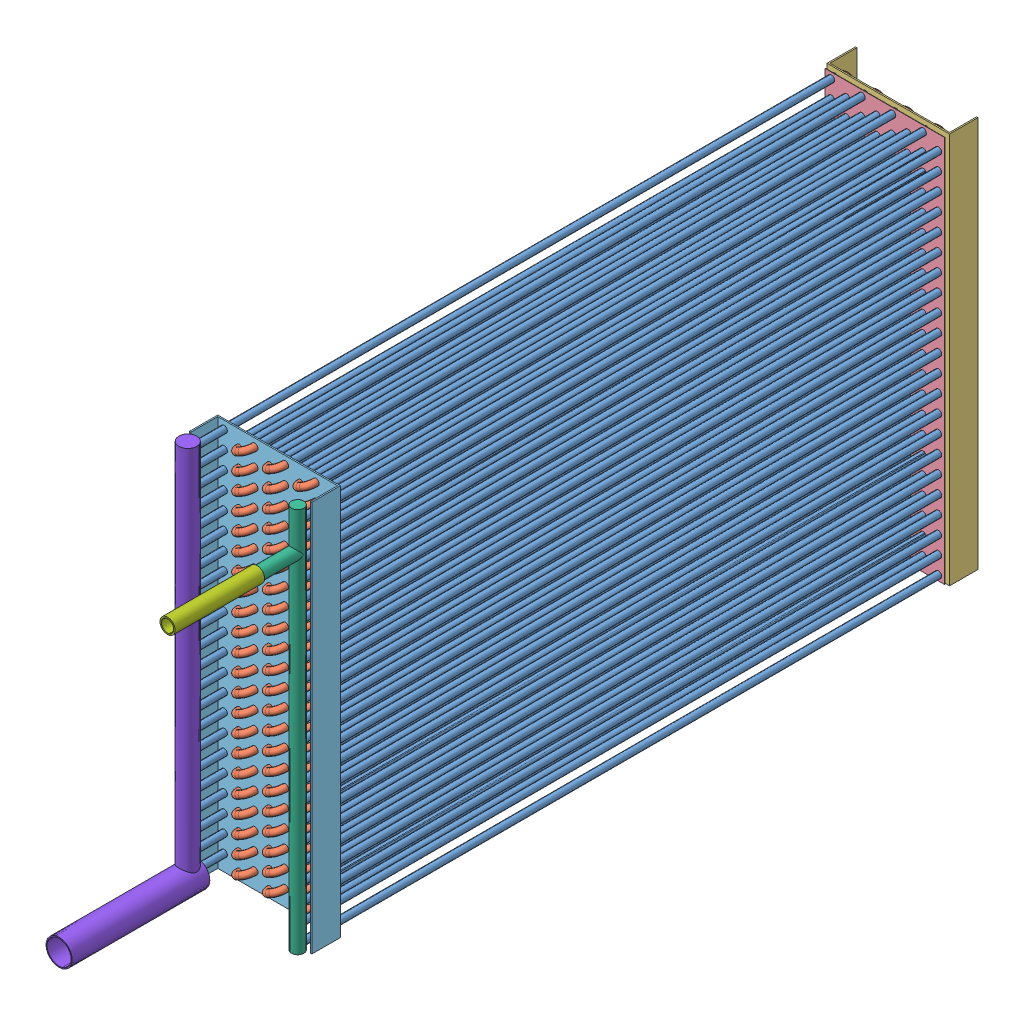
SolidWorks assembly emsamble evaporador.SLDASM, configuration Predeterminado (file format 4400). Lengths in mm.
Overall size (185.79 568.45 1168.05).
234 component instances, 8 part files, 23 mates.
Components (placement in the parent):
- tubos arreglo evaporador-1: tubos arreglo evaporador.SLDPRT [Predeterminado] at (336.7188 419.7134 451.027) size (165.1 555.62 930.27)
- union arreglo evaporador-1: union arreglo evaporador.SLDPRT [Predeterminado] at (336.7188 419.7134 -437.973) x (0.868243 -0.496139 0) z (0 0 1) size (35.12 9.53 14.76)
- soporte evaporador serpentin-1: soporte evaporador serpentin.SLDPRT [Predeterminado] at (169.9313 443.5894 -477.248) x (1 0 0) z (0 -1 0) size (178 41.27 568.45)
- union arreglo evaporador-5: union arreglo evaporador.SLDPRT [Predeterminado] at (336.7188 394.3134 -437.973) x (0.868243 -0.496139 0) z (0 0 1) size (35.12 9.53 14.76)
- union arreglo evaporador-6: union arreglo evaporador.SLDPRT [Predeterminado] at (336.7188 368.9134 -437.973) x (0.868243 -0.496139 0) z (0 0 1) size (35.12 9.53 14.76)
- union arreglo evaporador-7: union arreglo evaporador.SLDPRT [Predeterminado] at (336.7188 343.5134 -437.973) x (0.868243 -0.496139 0) z (0 0 1) size (35.12 9.53 14.76)
- union arreglo evaporador-8: union arreglo evaporador.SLDPRT [Predeterminado] at (336.7188 318.1134 -437.973) x (0.868243 -0.496139 0) z (0 0 1) size (35.12 9.53 14.76)
- union arreglo evaporador-9: union arreglo evaporador.SLDPRT [Predeterminado] at (336.7188 292.7134 -437.973) x (0.868243 -0.496139 0) z (0 0 1) size (35.12 9.53 14.76)
- union arreglo evaporador-10: union arreglo evaporador.SLDPRT [Predeterminado] at (336.7188 267.3134 -437.973) x (0.868243 -0.496139 0) z (0 0 1) size (35.12 9.53 14.76)
- union arreglo evaporador-11: union arreglo evaporador.SLDPRT [Predeterminado] at (336.7188 241.9134 -437.973) x (0.868243 -0.496139 0) z (0 0 1) size (35.12 9.53 14.76)
- union arreglo evaporador-12: union arreglo evaporador.SLDPRT [Predeterminado] at (336.7188 216.5134 -437.973) x (0.868243 -0.496139 0) z (0 0 1) size (35.12 9.53 14.76)
- union arreglo evaporador-13: union arreglo evaporador.SLDPRT [Predeterminado] at (336.7188 191.1134 -437.973) x (0.868243 -0.496139 0) z (0 0 1) size (35.12 9.53 14.76)
- union arreglo evaporador-14: union arreglo evaporador.SLDPRT [Predeterminado] at (336.7188 165.7134 -437.973) x (0.868243 -0.496139 0) z (0 0 1) size (35.12 9.53 14.76)
- union arreglo evaporador-15: union arreglo evaporador.SLDPRT [Predeterminado] at (336.7188 140.3134 -437.973) x (0.868243 -0.496139 0) z (0 0 1) size (35.12 9.53 14.76)
- union arreglo evaporador-16: union arreglo evaporador.SLDPRT [Predeterminado] at (336.7188 114.9134 -437.973) x (0.868243 -0.496139 0) z (0 0 1) size (35.12 9.53 14.76)
- union arreglo evaporador-17: union arreglo evaporador.SLDPRT [Predeterminado] at (336.7188 89.5134 -437.973) x (0.868243 -0.496139 0) z (0 0 1) size (35.12 9.53 14.76)
- union arreglo evaporador-18: union arreglo evaporador.SLDPRT [Predeterminado] at (336.7188 64.1134 -437.973) x (0.868243 -0.496139 0) z (0 0 1) size (35.12 9.53 14.76)
- union arreglo evaporador-19: union arreglo evaporador.SLDPRT [Predeterminado] at (336.7188 38.7134 -437.973) x (0.868243 -0.496139 0) z (0 0 1) size (35.12 9.53 14.76)
- union arreglo evaporador-20: union arreglo evaporador.SLDPRT [Predeterminado] at (336.7188 13.3134 -437.973) x (0.868243 -0.496139 0) z (0 0 1) size (35.12 9.53 14.76)
- union arreglo evaporador-21: union arreglo evaporador.SLDPRT [Predeterminado] at (336.7188 -12.0866 -437.973) x (0.868243 -0.496139 0) z (0 0 1) size (35.12 9.53 14.76)
- union arreglo evaporador-22: union arreglo evaporador.SLDPRT [Predeterminado] at (336.7188 -37.4866 -437.973) x (0.868243 -0.496139 0) z (0 0 1) size (35.12 9.53 14.76)
- union arreglo evaporador-23: union arreglo evaporador.SLDPRT [Predeterminado] at (336.7188 -62.8866 -437.973) x (0.868243 -0.496139 0) z (0 0 1) size (35.12 9.53 14.76)
- union arreglo evaporador-24: union arreglo evaporador.SLDPRT [Predeterminado] at (336.7188 -88.2866 -437.973) x (0.868243 -0.496139 0) z (0 0 1) size (35.12 9.53 14.76)
- union arreglo evaporador-25: union arreglo evaporador.SLDPRT [Predeterminado] at (336.7188 -113.6866 -437.973) x (0.868243 -0.496139 0) z (0 0 1) size (35.12 9.53 14.76)
- union arreglo evaporador-26: union arreglo evaporador.SLDPRT [Predeterminado] at (292.2688 419.7134 -437.973) x (0.868243 -0.496139 0) z (0 0 1) size (35.12 9.53 14.76)
- union arreglo evaporador-27: union arreglo evaporador.SLDPRT [Predeterminado] at (292.2688 394.3134 -437.973) x (0.868243 -0.496139 0) z (0 0 1) size (35.12 9.53 14.76)
- union arreglo evaporador-28: union arreglo evaporador.SLDPRT [Predeterminado] at (292.2688 368.9134 -437.973) x (0.868243 -0.496139 0) z (0 0 1) size (35.12 9.53 14.76)
- union arreglo evaporador-29: union arreglo evaporador.SLDPRT [Predeterminado] at (292.2688 343.5134 -437.973) x (0.868243 -0.496139 0) z (0 0 1) size (35.12 9.53 14.76)
- union arreglo evaporador-30: union arreglo evaporador.SLDPRT [Predeterminado] at (292.2688 318.1134 -437.973) x (0.868243 -0.496139 0) z (0 0 1) size (35.12 9.53 14.76)
- union arreglo evaporador-31: union arreglo evaporador.SLDPRT [Predeterminado] at (292.2688 292.7134 -437.973) x (0.868243 -0.496139 0) z (0 0 1) size (35.12 9.53 14.76)
- union arreglo evaporador-32: union arreglo evaporador.SLDPRT [Predeterminado] at (292.2688 267.3134 -437.973) x (0.868243 -0.496139 0) z (0 0 1) size (35.12 9.53 14.76)
- union arreglo evaporador-33: union arreglo evaporador.SLDPRT [Predeterminado] at (292.2688 241.9134 -437.973) x (0.868243 -0.496139 0) z (0 0 1) size (35.12 9.53 14.76)
- union arreglo evaporador-34: union arreglo evaporador.SLDPRT [Predeterminado] at (292.2688 216.5134 -437.973) x (0.868243 -0.496139 0) z (0 0 1) size (35.12 9.53 14.76)
- union arreglo evaporador-35: union arreglo evaporador.SLDPRT [Predeterminado] at (292.2688 191.1134 -437.973) x (0.868243 -0.496139 0) z (0 0 1) size (35.12 9.53 14.76)
- union arreglo evaporador-36: union arreglo evaporador.SLDPRT [Predeterminado] at (292.2688 165.7134 -437.973) x (0.868243 -0.496139 0) z (0 0 1) size (35.12 9.53 14.76)
- union arreglo evaporador-37: union arreglo evaporador.SLDPRT [Predeterminado] at (292.2688 140.3134 -437.973) x (0.868243 -0.496139 0) z (0 0 1) size (35.12 9.53 14.76)
- union arreglo evaporador-38: union arreglo evaporador.SLDPRT [Predeterminado] at (292.2688 114.9134 -437.973) x (0.868243 -0.496139 0) z (0 0 1) size (35.12 9.53 14.76)
- union arreglo evaporador-39: union arreglo evaporador.SLDPRT [Predeterminado] at (292.2688 89.5134 -437.973) x (0.868243 -0.496139 0) z (0 0 1) size (35.12 9.53 14.76)
- union arreglo evaporador-40: union arreglo evaporador.SLDPRT [Predeterminado] at (292.2688 64.1134 -437.973) x (0.868243 -0.496139 0) z (0 0 1) size (35.12 9.53 14.76)
- union arreglo evaporador-41: union arreglo evaporador.SLDPRT [Predeterminado] at (292.2688 38.7134 -437.973) x (0.868243 -0.496139 0) z (0 0 1) size (35.12 9.53 14.76)
- union arreglo evaporador-42: union arreglo evaporador.SLDPRT [Predeterminado] at (292.2688 13.3134 -437.973) x (0.868243 -0.496139 0) z (0 0 1) size (35.12 9.53 14.76)
- union arreglo evaporador-43: union arreglo evaporador.SLDPRT [Predeterminado] at (292.2688 -12.0866 -437.973) x (0.868243 -0.496139 0) z (0 0 1) size (35.12 9.53 14.76)
- union arreglo evaporador-44: union arreglo evaporador.SLDPRT [Predeterminado] at (292.2688 -37.4866 -437.973) x (0.868243 -0.496139 0) z (0 0 1) size (35.12 9.53 14.76)
- union arreglo evaporador-45: union arreglo evaporador.SLDPRT [Predeterminado] at (292.2688 -62.8866 -437.973) x (0.868243 -0.496139 0) z (0 0 1) size (35.12 9.53 14.76)
- union arreglo evaporador-46: union arreglo evaporador.SLDPRT [Predeterminado] at (292.2688 -88.2866 -437.973) x (0.868243 -0.496139 0) z (0 0 1) size (35.12 9.53 14.76)
- union arreglo evaporador-47: union arreglo evaporador.SLDPRT [Predeterminado] at (292.2688 -113.6866 -437.973) x (0.868243 -0.496139 0) z (0 0 1) size (35.12 9.53 14.76)
- union arreglo evaporador-48: union arreglo evaporador.SLDPRT [Predeterminado] at (247.8188 419.7134 -437.973) x (0.868243 -0.496139 0) z (0 0 1) size (35.12 9.53 14.76)
- union arreglo evaporador-49: union arreglo evaporador.SLDPRT [Predeterminado] at (247.8188 394.3134 -437.973) x (0.868243 -0.496139 0) z (0 0 1) size (35.12 9.53 14.76)
- union arreglo evaporador-50: union arreglo evaporador.SLDPRT [Predeterminado] at (247.8188 368.9134 -437.973) x (0.868243 -0.496139 0) z (0 0 1) size (35.12 9.53 14.76)
- union arreglo evaporador-51: union arreglo evaporador.SLDPRT [Predeterminado] at (247.8188 343.5134 -437.973) x (0.868243 -0.496139 0) z (0 0 1) size (35.12 9.53 14.76)
- union arreglo evaporador-52: union arreglo evaporador.SLDPRT [Predeterminado] at (247.8188 318.1134 -437.973) x (0.868243 -0.496139 0) z (0 0 1) size (35.12 9.53 14.76)
- union arreglo evaporador-53: union arreglo evaporador.SLDPRT [Predeterminado] at (247.8188 292.7134 -437.973) x (0.868243 -0.496139 0) z (0 0 1) size (35.12 9.53 14.76)
- union arreglo evaporador-54: union arreglo evaporador.SLDPRT [Predeterminado] at (247.8188 267.3134 -437.973) x (0.868243 -0.496139 0) z (0 0 1) size (35.12 9.53 14.76)
- union arreglo evaporador-55: union arreglo evaporador.SLDPRT [Predeterminado] at (247.8188 241.9134 -437.973) x (0.868243 -0.496139 0) z (0 0 1) size (35.12 9.53 14.76)
- union arreglo evaporador-56: union arreglo evaporador.SLDPRT [Predeterminado] at (247.8188 216.5134 -437.973) x (0.868243 -0.496139 0) z (0 0 1) size (35.12 9.53 14.76)
- union arreglo evaporador-57: union arreglo evaporador.SLDPRT [Predeterminado] at (247.8188 191.1134 -437.973) x (0.868243 -0.496139 0) z (0 0 1) size (35.12 9.53 14.76)
- union arreglo evaporador-58: union arreglo evaporador.SLDPRT [Predeterminado] at (247.8188 165.7134 -437.973) x (0.868243 -0.496139 0) z (0 0 1) size (35.12 9.53 14.76)
- union arreglo evaporador-59: union arreglo evaporador.SLDPRT [Predeterminado] at (247.8188 140.3134 -437.973) x (0.868243 -0.496139 0) z (0 0 1) size (35.12 9.53 14.76)
- union arreglo evaporador-60: union arreglo evaporador.SLDPRT [Predeterminado] at (247.8188 114.9134 -437.973) x (0.868243 -0.496139 0) z (0 0 1) size (35.12 9.53 14.76)
- union arreglo evaporador-61: union arreglo evaporador.SLDPRT [Predeterminado] at (247.8188 89.5134 -437.973) x (0.868243 -0.496139 0) z (0 0 1) size (35.12 9.53 14.76)
- union arreglo evaporador-62: union arreglo evaporador.SLDPRT [Predeterminado] at (247.8188 64.1134 -437.973) x (0.868243 -0.496139 0) z (0 0 1) size (35.12 9.53 14.76)
- union arreglo evaporador-63: union arreglo evaporador.SLDPRT [Predeterminado] at (247.8188 38.7134 -437.973) x (0.868243 -0.496139 0) z (0 0 1) size (35.12 9.53 14.76)
- union arreglo evaporador-64: union arreglo evaporador.SLDPRT [Predeterminado] at (247.8188 13.3134 -437.973) x (0.868243 -0.496139 0) z (0 0 1) size (35.12 9.53 14.76)
- union arreglo evaporador-65: union arreglo evaporador.SLDPRT [Predeterminado] at (247.8188 -12.0866 -437.973) x (0.868243 -0.496139 0) z (0 0 1) size (35.12 9.53 14.76)
- union arreglo evaporador-66: union arreglo evaporador.SLDPRT [Predeterminado] at (247.8188 -37.4866 -437.973) x (0.868243 -0.496139 0) z (0 0 1) size (35.12 9.53 14.76)
- union arreglo evaporador-67: union arreglo evaporador.SLDPRT [Predeterminado] at (247.8188 -62.8866 -437.973) x (0.868243 -0.496139 0) z (0 0 1) size (35.12 9.53 14.76)
- union arreglo evaporador-68: union arreglo evaporador.SLDPRT [Predeterminado] at (247.8188 -88.2866 -437.973) x (0.868243 -0.496139 0) z (0 0 1) size (35.12 9.53 14.76)
- union arreglo evaporador-69: union arreglo evaporador.SLDPRT [Predeterminado] at (247.8188 -113.6866 -437.973) x (0.868243 -0.496139 0) z (0 0 1) size (35.12 9.53 14.76)
- union arreglo evaporador-70: union arreglo evaporador.SLDPRT [Predeterminado] at (203.3688 419.7134 -437.973) x (0.868243 -0.496139 0) z (0 0 1) size (35.12 9.53 14.76)
- union arreglo evaporador-71: union arreglo evaporador.SLDPRT [Predeterminado] at (203.3688 394.3134 -437.973) x (0.868243 -0.496139 0) z (0 0 1) size (35.12 9.53 14.76)
- union arreglo evaporador-72: union arreglo evaporador.SLDPRT [Predeterminado] at (203.3688 368.9134 -437.973) x (0.868243 -0.496139 0) z (0 0 1) size (35.12 9.53 14.76)
- union arreglo evaporador-73: union arreglo evaporador.SLDPRT [Predeterminado] at (203.3688 343.5134 -437.973) x (0.868243 -0.496139 0) z (0 0 1) size (35.12 9.53 14.76)
- union arreglo evaporador-74: union arreglo evaporador.SLDPRT [Predeterminado] at (203.3688 318.1134 -437.973) x (0.868243 -0.496139 0) z (0 0 1) size (35.12 9.53 14.76)
- union arreglo evaporador-75: union arreglo evaporador.SLDPRT [Predeterminado] at (203.3688 292.7134 -437.973) x (0.868243 -0.496139 0) z (0 0 1) size (35.12 9.53 14.76)
- union arreglo evaporador-76: union arreglo evaporador.SLDPRT [Predeterminado] at (203.3688 267.3134 -437.973) x (0.868243 -0.496139 0) z (0 0 1) size (35.12 9.53 14.76)
- union arreglo evaporador-77: union arreglo evaporador.SLDPRT [Predeterminado] at (203.3688 241.9134 -437.973) x (0.868243 -0.496139 0) z (0 0 1) size (35.12 9.53 14.76)
- union arreglo evaporador-78: union arreglo evaporador.SLDPRT [Predeterminado] at (203.3688 216.5134 -437.973) x (0.868243 -0.496139 0) z (0 0 1) size (35.12 9.53 14.76)
- union arreglo evaporador-79: union arreglo evaporador.SLDPRT [Predeterminado] at (203.3688 191.1134 -437.973) x (0.868243 -0.496139 0) z (0 0 1) size (35.12 9.53 14.76)
- union arreglo evaporador-80: union arreglo evaporador.SLDPRT [Predeterminado] at (203.3688 165.7134 -437.973) x (0.868243 -0.496139 0) z (0 0 1) size (35.12 9.53 14.76)
- union arreglo evaporador-81: union arreglo evaporador.SLDPRT [Predeterminado] at (203.3688 140.3134 -437.973) x (0.868243 -0.496139 0) z (0 0 1) size (35.12 9.53 14.76)
- union arreglo evaporador-82: union arreglo evaporador.SLDPRT [Predeterminado] at (203.3688 114.9134 -437.973) x (0.868243 -0.496139 0) z (0 0 1) size (35.12 9.53 14.76)
- union arreglo evaporador-83: union arreglo evaporador.SLDPRT [Predeterminado] at (203.3688 89.5134 -437.973) x (0.868243 -0.496139 0) z (0 0 1) size (35.12 9.53 14.76)
- union arreglo evaporador-84: union arreglo evaporador.SLDPRT [Predeterminado] at (203.3688 64.1134 -437.973) x (0.868243 -0.496139 0) z (0 0 1) size (35.12 9.53 14.76)
- union arreglo evaporador-85: union arreglo evaporador.SLDPRT [Predeterminado] at (203.3688 38.7134 -437.973) x (0.868243 -0.496139 0) z (0 0 1) size (35.12 9.53 14.76)
- union arreglo evaporador-86: union arreglo evaporador.SLDPRT [Predeterminado] at (203.3688 13.3134 -437.973) x (0.868243 -0.496139 0) z (0 0 1) size (35.12 9.53 14.76)
- union arreglo evaporador-87: union arreglo evaporador.SLDPRT [Predeterminado] at (203.3688 -12.0866 -437.973) x (0.868243 -0.496139 0) z (0 0 1) size (35.12 9.53 14.76)
- union arreglo evaporador-88: union arreglo evaporador.SLDPRT [Predeterminado] at (203.3688 -37.4866 -437.973) x (0.868243 -0.496139 0) z (0 0 1) size (35.12 9.53 14.76)
- union arreglo evaporador-89: union arreglo evaporador.SLDPRT [Predeterminado] at (203.3688 -62.8866 -437.973) x (0.868243 -0.496139 0) z (0 0 1) size (35.12 9.53 14.76)
- union arreglo evaporador-90: union arreglo evaporador.SLDPRT [Predeterminado] at (203.3688 -88.2866 -437.973) x (0.868243 -0.496139 0) z (0 0 1) size (35.12 9.53 14.76)
- union arreglo evaporador-91: union arreglo evaporador.SLDPRT [Predeterminado] at (203.3688 -113.6866 -437.973) x (0.868243 -0.496139 0) z (0 0 1) size (35.12 9.53 14.76)
- union arreglo evaporador-92: union arreglo evaporador.SLDPRT [Predeterminado] at (314.4938 432.4134 451.027) x (0.868243 0.496139 0) z (0 0 -1) size (35.12 9.53 14.76)
- aleta serpentin evaporador-1: aleta serpentin evaporador.SLDPRT [Predeterminado] at (172.1438 440.5894 -430.973) x (1 0 0) z (0 1 0) size (173.58 0.5 562.45)
- soporte evaporador serpentin lado entrad y salida-1: soporte evaporador serpentin lado entrad y salida.SLDPRT [Predeterminado] at (169.9313 -124.8626 490.302) x (1 0 0) z (0 1 0) size (178 41.27 568.45)
- union arreglo evaporador-93: union arreglo evaporador.SLDPRT [Predeterminado] at (314.4938 407.0134 451.027) x (0.868243 0.496139 0) z (0 0 -1) size (35.12 9.53 14.76)
- union arreglo evaporador-94: union arreglo evaporador.SLDPRT [Predeterminado] at (314.4938 381.6134 451.027) x (0.868243 0.496139 0) z (0 0 -1) size (35.12 9.53 14.76)
- union arreglo evaporador-95: union arreglo evaporador.SLDPRT [Predeterminado] at (314.4938 356.2134 451.027) x (0.868243 0.496139 0) z (0 0 -1) size (35.12 9.53 14.76)
- union arreglo evaporador-96: union arreglo evaporador.SLDPRT [Predeterminado] at (314.4938 330.8134 451.027) x (0.868243 0.496139 0) z (0 0 -1) size (35.12 9.53 14.76)
- union arreglo evaporador-97: union arreglo evaporador.SLDPRT [Predeterminado] at (314.4938 305.4134 451.027) x (0.868243 0.496139 0) z (0 0 -1) size (35.12 9.53 14.76)
- union arreglo evaporador-98: union arreglo evaporador.SLDPRT [Predeterminado] at (314.4938 280.0134 451.027) x (0.868243 0.496139 0) z (0 0 -1) size (35.12 9.53 14.76)
- union arreglo evaporador-99: union arreglo evaporador.SLDPRT [Predeterminado] at (314.4938 254.6134 451.027) x (0.868243 0.496139 0) z (0 0 -1) size (35.12 9.53 14.76)
- union arreglo evaporador-100: union arreglo evaporador.SLDPRT [Predeterminado] at (314.4938 229.2134 451.027) x (0.868243 0.496139 0) z (0 0 -1) size (35.12 9.53 14.76)
- union arreglo evaporador-101: union arreglo evaporador.SLDPRT [Predeterminado] at (314.4938 203.8134 451.027) x (0.868243 0.496139 0) z (0 0 -1) size (35.12 9.53 14.76)
- union arreglo evaporador-102: union arreglo evaporador.SLDPRT [Predeterminado] at (314.4938 178.4134 451.027) x (0.868243 0.496139 0) z (0 0 -1) size (35.12 9.53 14.76)
- union arreglo evaporador-103: union arreglo evaporador.SLDPRT [Predeterminado] at (314.4938 153.0134 451.027) x (0.868243 0.496139 0) z (0 0 -1) size (35.12 9.53 14.76)
- union arreglo evaporador-104: union arreglo evaporador.SLDPRT [Predeterminado] at (314.4938 127.6134 451.027) x (0.868243 0.496139 0) z (0 0 -1) size (35.12 9.53 14.76)
- union arreglo evaporador-105: union arreglo evaporador.SLDPRT [Predeterminado] at (314.4938 102.2134 451.027) x (0.868243 0.496139 0) z (0 0 -1) size (35.12 9.53 14.76)
- union arreglo evaporador-106: union arreglo evaporador.SLDPRT [Predeterminado] at (314.4938 76.8134 451.027) x (0.868243 0.496139 0) z (0 0 -1) size (35.12 9.53 14.76)
- union arreglo evaporador-107: union arreglo evaporador.SLDPRT [Predeterminado] at (314.4938 51.4134 451.027) x (0.868243 0.496139 0) z (0 0 -1) size (35.12 9.53 14.76)
- union arreglo evaporador-108: union arreglo evaporador.SLDPRT [Predeterminado] at (314.4938 26.0134 451.027) x (0.868243 0.496139 0) z (0 0 -1) size (35.12 9.53 14.76)
- union arreglo evaporador-109: union arreglo evaporador.SLDPRT [Predeterminado] at (314.4938 0.6134 451.027) x (0.868243 0.496139 0) z (0 0 -1) size (35.12 9.53 14.76)
- union arreglo evaporador-110: union arreglo evaporador.SLDPRT [Predeterminado] at (314.4938 -24.7866 451.027) x (0.868243 0.496139 0) z (0 0 -1) size (35.12 9.53 14.76)
- union arreglo evaporador-111: union arreglo evaporador.SLDPRT [Predeterminado] at (314.4938 -50.1866 451.027) x (0.868243 0.496139 0) z (0 0 -1) size (35.12 9.53 14.76)
- union arreglo evaporador-112: union arreglo evaporador.SLDPRT [Predeterminado] at (314.4938 -75.5866 451.027) x (0.868243 0.496139 0) z (0 0 -1) size (35.12 9.53 14.76)
- union arreglo evaporador-113: union arreglo evaporador.SLDPRT [Predeterminado] at (314.4938 -100.9866 451.027) x (0.868243 0.496139 0) z (0 0 -1) size (35.12 9.53 14.76)
- union arreglo evaporador-114: union arreglo evaporador.SLDPRT [Predeterminado] at (270.0438 432.4134 451.027) x (0.868243 0.496139 0) z (0 0 -1) size (35.12 9.53 14.76)
- union arreglo evaporador-115: union arreglo evaporador.SLDPRT [Predeterminado] at (270.0438 407.0134 451.027) x (0.868243 0.496139 0) z (0 0 -1) size (35.12 9.53 14.76)
- union arreglo evaporador-116: union arreglo evaporador.SLDPRT [Predeterminado] at (270.0438 381.6134 451.027) x (0.868243 0.496139 0) z (0 0 -1) size (35.12 9.53 14.76)
- union arreglo evaporador-117: union arreglo evaporador.SLDPRT [Predeterminado] at (270.0438 356.2134 451.027) x (0.868243 0.496139 0) z (0 0 -1) size (35.12 9.53 14.76)
- union arreglo evaporador-118: union arreglo evaporador.SLDPRT [Predeterminado] at (270.0438 330.8134 451.027) x (0.868243 0.496139 0) z (0 0 -1) size (35.12 9.53 14.76)
- union arreglo evaporador-119: union arreglo evaporador.SLDPRT [Predeterminado] at (270.0438 305.4134 451.027) x (0.868243 0.496139 0) z (0 0 -1) size (35.12 9.53 14.76)
- union arreglo evaporador-120: union arreglo evaporador.SLDPRT [Predeterminado] at (270.0438 280.0134 451.027) x (0.868243 0.496139 0) z (0 0 -1) size (35.12 9.53 14.76)
- union arreglo evaporador-121: union arreglo evaporador.SLDPRT [Predeterminado] at (270.0438 254.6134 451.027) x (0.868243 0.496139 0) z (0 0 -1) size (35.12 9.53 14.76)
- union arreglo evaporador-122: union arreglo evaporador.SLDPRT [Predeterminado] at (270.0438 229.2134 451.027) x (0.868243 0.496139 0) z (0 0 -1) size (35.12 9.53 14.76)
- union arreglo evaporador-123: union arreglo evaporador.SLDPRT [Predeterminado] at (270.0438 203.8134 451.027) x (0.868243 0.496139 0) z (0 0 -1) size (35.12 9.53 14.76)
- union arreglo evaporador-124: union arreglo evaporador.SLDPRT [Predeterminado] at (270.0438 178.4134 451.027) x (0.868243 0.496139 0) z (0 0 -1) size (35.12 9.53 14.76)
- union arreglo evaporador-125: union arreglo evaporador.SLDPRT [Predeterminado] at (270.0438 153.0134 451.027) x (0.868243 0.496139 0) z (0 0 -1) size (35.12 9.53 14.76)
- union arreglo evaporador-126: union arreglo evaporador.SLDPRT [Predeterminado] at (270.0438 127.6134 451.027) x (0.868243 0.496139 0) z (0 0 -1) size (35.12 9.53 14.76)
- union arreglo evaporador-127: union arreglo evaporador.SLDPRT [Predeterminado] at (270.0438 102.2134 451.027) x (0.868243 0.496139 0) z (0 0 -1) size (35.12 9.53 14.76)
- union arreglo evaporador-128: union arreglo evaporador.SLDPRT [Predeterminado] at (270.0438 76.8134 451.027) x (0.868243 0.496139 0) z (0 0 -1) size (35.12 9.53 14.76)
- union arreglo evaporador-129: union arreglo evaporador.SLDPRT [Predeterminado] at (270.0438 51.4134 451.027) x (0.868243 0.496139 0) z (0 0 -1) size (35.12 9.53 14.76)
- union arreglo evaporador-130: union arreglo evaporador.SLDPRT [Predeterminado] at (270.0438 26.0134 451.027) x (0.868243 0.496139 0) z (0 0 -1) size (35.12 9.53 14.76)
- union arreglo evaporador-131: union arreglo evaporador.SLDPRT [Predeterminado] at (270.0438 0.6134 451.027) x (0.868243 0.496139 0) z (0 0 -1) size (35.12 9.53 14.76)
- union arreglo evaporador-132: union arreglo evaporador.SLDPRT [Predeterminado] at (270.0438 -24.7866 451.027) x (0.868243 0.496139 0) z (0 0 -1) size (35.12 9.53 14.76)
- union arreglo evaporador-133: union arreglo evaporador.SLDPRT [Predeterminado] at (270.0438 -50.1866 451.027) x (0.868243 0.496139 0) z (0 0 -1) size (35.12 9.53 14.76)
- union arreglo evaporador-134: union arreglo evaporador.SLDPRT [Predeterminado] at (270.0438 -75.5866 451.027) x (0.868243 0.496139 0) z (0 0 -1) size (35.12 9.53 14.76)
- union arreglo evaporador-135: union arreglo evaporador.SLDPRT [Predeterminado] at (270.0438 -100.9866 451.027) x (0.868243 0.496139 0) z (0 0 -1) size (35.12 9.53 14.76)
- union arreglo evaporador-136: union arreglo evaporador.SLDPRT [Predeterminado] at (225.5938 432.4134 451.027) x (0.868243 0.496139 0) z (0 0 -1) size (35.12 9.53 14.76)
- union arreglo evaporador-137: union arreglo evaporador.SLDPRT [Predeterminado] at (225.5938 407.0134 451.027) x (0.868243 0.496139 0) z (0 0 -1) size (35.12 9.53 14.76)
- union arreglo evaporador-138: union arreglo evaporador.SLDPRT [Predeterminado] at (225.5938 381.6134 451.027) x (0.868243 0.496139 0) z (0 0 -1) size (35.12 9.53 14.76)
- union arreglo evaporador-139: union arreglo evaporador.SLDPRT [Predeterminado] at (225.5938 356.2134 451.027) x (0.868243 0.496139 0) z (0 0 -1) size (35.12 9.53 14.76)
- union arreglo evaporador-140: union arreglo evaporador.SLDPRT [Predeterminado] at (225.5938 330.8134 451.027) x (0.868243 0.496139 0) z (0 0 -1) size (35.12 9.53 14.76)
- union arreglo evaporador-141: union arreglo evaporador.SLDPRT [Predeterminado] at (225.5938 305.4134 451.027) x (0.868243 0.496139 0) z (0 0 -1) size (35.12 9.53 14.76)
- union arreglo evaporador-142: union arreglo evaporador.SLDPRT [Predeterminado] at (225.5938 280.0134 451.027) x (0.868243 0.496139 0) z (0 0 -1) size (35.12 9.53 14.76)
- union arreglo evaporador-143: union arreglo evaporador.SLDPRT [Predeterminado] at (225.5938 254.6134 451.027) x (0.868243 0.496139 0) z (0 0 -1) size (35.12 9.53 14.76)
- union arreglo evaporador-144: union arreglo evaporador.SLDPRT [Predeterminado] at (225.5938 229.2134 451.027) x (0.868243 0.496139 0) z (0 0 -1) size (35.12 9.53 14.76)
- union arreglo evaporador-145: union arreglo evaporador.SLDPRT [Predeterminado] at (225.5938 203.8134 451.027) x (0.868243 0.496139 0) z (0 0 -1) size (35.12 9.53 14.76)
- union arreglo evaporador-146: union arreglo evaporador.SLDPRT [Predeterminado] at (225.5938 178.4134 451.027) x (0.868243 0.496139 0) z (0 0 -1) size (35.12 9.53 14.76)
- union arreglo evaporador-147: union arreglo evaporador.SLDPRT [Predeterminado] at (225.5938 153.0134 451.027) x (0.868243 0.496139 0) z (0 0 -1) size (35.12 9.53 14.76)
- union arreglo evaporador-148: union arreglo evaporador.SLDPRT [Predeterminado] at (225.5938 127.6134 451.027) x (0.868243 0.496139 0) z (0 0 -1) size (35.12 9.53 14.76)
- union arreglo evaporador-149: union arreglo evaporador.SLDPRT [Predeterminado] at (225.5938 102.2134 451.027) x (0.868243 0.496139 0) z (0 0 -1) size (35.12 9.53 14.76)
- union arreglo evaporador-150: union arreglo evaporador.SLDPRT [Predeterminado] at (225.5938 76.8134 451.027) x (0.868243 0.496139 0) z (0 0 -1) size (35.12 9.53 14.76)
- union arreglo evaporador-151: union arreglo evaporador.SLDPRT [Predeterminado] at (225.5938 51.4134 451.027) x (0.868243 0.496139 0) z (0 0 -1) size (35.12 9.53 14.76)
- union arreglo evaporador-152: union arreglo evaporador.SLDPRT [Predeterminado] at (225.5938 26.0134 451.027) x (0.868243 0.496139 0) z (0 0 -1) size (35.12 9.53 14.76)
- union arreglo evaporador-153: union arreglo evaporador.SLDPRT [Predeterminado] at (225.5938 0.6134 451.027) x (0.868243 0.496139 0) z (0 0 -1) size (35.12 9.53 14.76)
- union arreglo evaporador-154: union arreglo evaporador.SLDPRT [Predeterminado] at (225.5938 -24.7866 451.027) x (0.868243 0.496139 0) z (0 0 -1) size (35.12 9.53 14.76)
- union arreglo evaporador-155: union arreglo evaporador.SLDPRT [Predeterminado] at (225.5938 -50.1866 451.027) x (0.868243 0.496139 0) z (0 0 -1) size (35.12 9.53 14.76)
- union arreglo evaporador-156: union arreglo evaporador.SLDPRT [Predeterminado] at (225.5938 -75.5866 451.027) x (0.868243 0.496139 0) z (0 0 -1) size (35.12 9.53 14.76)
- union arreglo evaporador-157: union arreglo evaporador.SLDPRT [Predeterminado] at (225.5938 -100.9866 451.027) x (0.868243 0.496139 0) z (0 0 -1) size (35.12 9.53 14.76)
- aleta serpentin evaporador-2: aleta serpentin evaporador.SLDPRT [Predeterminado] at (172.1438 440.5894 -418.973) x (1 0 0) z (0 1 0) size (173.58 0.5 562.45) (hidden)
- aleta serpentin evaporador-3: aleta serpentin evaporador.SLDPRT [Predeterminado] at (172.1438 440.5894 -406.973) x (1 0 0) z (0 1 0) size (173.58 0.5 562.45) (hidden)
- aleta serpentin evaporador-4: aleta serpentin evaporador.SLDPRT [Predeterminado] at (172.1438 440.5894 -394.973) x (1 0 0) z (0 1 0) size (173.58 0.5 562.45) (hidden)
- aleta serpentin evaporador-5: aleta serpentin evaporador.SLDPRT [Predeterminado] at (172.1438 440.5894 -382.973) x (1 0 0) z (0 1 0) size (173.58 0.5 562.45) (hidden)
- aleta serpentin evaporador-6: aleta serpentin evaporador.SLDPRT [Predeterminado] at (172.1438 440.5894 -370.973) x (1 0 0) z (0 1 0) size (173.58 0.5 562.45) (hidden)
- aleta serpentin evaporador-7: aleta serpentin evaporador.SLDPRT [Predeterminado] at (172.1438 440.5894 -358.973) x (1 0 0) z (0 1 0) size (173.58 0.5 562.45) (hidden)
- aleta serpentin evaporador-8: aleta serpentin evaporador.SLDPRT [Predeterminado] at (172.1438 440.5894 -346.973) x (1 0 0) z (0 1 0) size (173.58 0.5 562.45) (hidden)
- aleta serpentin evaporador-9: aleta serpentin evaporador.SLDPRT [Predeterminado] at (172.1438 440.5894 -334.973) x (1 0 0) z (0 1 0) size (173.58 0.5 562.45) (hidden)
- aleta serpentin evaporador-10: aleta serpentin evaporador.SLDPRT [Predeterminado] at (172.1438 440.5894 -322.973) x (1 0 0) z (0 1 0) size (173.58 0.5 562.45) (hidden)
- aleta serpentin evaporador-11: aleta serpentin evaporador.SLDPRT [Predeterminado] at (172.1438 440.5894 -310.973) x (1 0 0) z (0 1 0) size (173.58 0.5 562.45) (hidden)
- aleta serpentin evaporador-12: aleta serpentin evaporador.SLDPRT [Predeterminado] at (172.1438 440.5894 -298.973) x (1 0 0) z (0 1 0) size (173.58 0.5 562.45) (hidden)
- aleta serpentin evaporador-13: aleta serpentin evaporador.SLDPRT [Predeterminado] at (172.1438 440.5894 -286.973) x (1 0 0) z (0 1 0) size (173.58 0.5 562.45) (hidden)
- aleta serpentin evaporador-14: aleta serpentin evaporador.SLDPRT [Predeterminado] at (172.1438 440.5894 -274.973) x (1 0 0) z (0 1 0) size (173.58 0.5 562.45) (hidden)
- aleta serpentin evaporador-15: aleta serpentin evaporador.SLDPRT [Predeterminado] at (172.1438 440.5894 -262.973) x (1 0 0) z (0 1 0) size (173.58 0.5 562.45) (hidden)
- aleta serpentin evaporador-16: aleta serpentin evaporador.SLDPRT [Predeterminado] at (172.1438 440.5894 -250.973) x (1 0 0) z (0 1 0) size (173.58 0.5 562.45) (hidden)
- aleta serpentin evaporador-17: aleta serpentin evaporador.SLDPRT [Predeterminado] at (172.1438 440.5894 -238.973) x (1 0 0) z (0 1 0) size (173.58 0.5 562.45) (hidden)
- aleta serpentin evaporador-18: aleta serpentin evaporador.SLDPRT [Predeterminado] at (172.1438 440.5894 -226.973) x (1 0 0) z (0 1 0) size (173.58 0.5 562.45) (hidden)
- aleta serpentin evaporador-19: aleta serpentin evaporador.SLDPRT [Predeterminado] at (172.1438 440.5894 -214.973) x (1 0 0) z (0 1 0) size (173.58 0.5 562.45) (hidden)
- aleta serpentin evaporador-20: aleta serpentin evaporador.SLDPRT [Predeterminado] at (172.1438 440.5894 -202.973) x (1 0 0) z (0 1 0) size (173.58 0.5 562.45) (hidden)
- aleta serpentin evaporador-21: aleta serpentin evaporador.SLDPRT [Predeterminado] at (172.1438 440.5894 -190.973) x (1 0 0) z (0 1 0) size (173.58 0.5 562.45) (hidden)
- aleta serpentin evaporador-22: aleta serpentin evaporador.SLDPRT [Predeterminado] at (172.1438 440.5894 -178.973) x (1 0 0) z (0 1 0) size (173.58 0.5 562.45) (hidden)
- aleta serpentin evaporador-23: aleta serpentin evaporador.SLDPRT [Predeterminado] at (172.1438 440.5894 -166.973) x (1 0 0) z (0 1 0) size (173.58 0.5 562.45) (hidden)
- aleta serpentin evaporador-24: aleta serpentin evaporador.SLDPRT [Predeterminado] at (172.1438 440.5894 -154.973) x (1 0 0) z (0 1 0) size (173.58 0.5 562.45) (hidden)
- aleta serpentin evaporador-25: aleta serpentin evaporador.SLDPRT [Predeterminado] at (172.1438 440.5894 -142.973) x (1 0 0) z (0 1 0) size (173.58 0.5 562.45) (hidden)
- aleta serpentin evaporador-26: aleta serpentin evaporador.SLDPRT [Predeterminado] at (172.1438 440.5894 -130.973) x (1 0 0) z (0 1 0) size (173.58 0.5 562.45) (hidden)
- aleta serpentin evaporador-27: aleta serpentin evaporador.SLDPRT [Predeterminado] at (172.1438 440.5894 -118.973) x (1 0 0) z (0 1 0) size (173.58 0.5 562.45) (hidden)
- aleta serpentin evaporador-28: aleta serpentin evaporador.SLDPRT [Predeterminado] at (172.1438 440.5894 -106.973) x (1 0 0) z (0 1 0) size (173.58 0.5 562.45) (hidden)
- aleta serpentin evaporador-29: aleta serpentin evaporador.SLDPRT [Predeterminado] at (172.1438 440.5894 -94.973) x (1 0 0) z (0 1 0) size (173.58 0.5 562.45) (hidden)
- aleta serpentin evaporador-30: aleta serpentin evaporador.SLDPRT [Predeterminado] at (172.1438 440.5894 -82.973) x (1 0 0) z (0 1 0) size (173.58 0.5 562.45) (hidden)
- aleta serpentin evaporador-31: aleta serpentin evaporador.SLDPRT [Predeterminado] at (172.1438 440.5894 -70.973) x (1 0 0) z (0 1 0) size (173.58 0.5 562.45) (hidden)
- aleta serpentin evaporador-32: aleta serpentin evaporador.SLDPRT [Predeterminado] at (172.1438 440.5894 -58.973) x (1 0 0) z (0 1 0) size (173.58 0.5 562.45) (hidden)
- aleta serpentin evaporador-33: aleta serpentin evaporador.SLDPRT [Predeterminado] at (172.1438 440.5894 -46.973) x (1 0 0) z (0 1 0) size (173.58 0.5 562.45) (hidden)
- aleta serpentin evaporador-34: aleta serpentin evaporador.SLDPRT [Predeterminado] at (172.1438 440.5894 -34.973) x (1 0 0) z (0 1 0) size (173.58 0.5 562.45) (hidden)
- aleta serpentin evaporador-35: aleta serpentin evaporador.SLDPRT [Predeterminado] at (172.1438 440.5894 -22.973) x (1 0 0) z (0 1 0) size (173.58 0.5 562.45) (hidden)
- aleta serpentin evaporador-36: aleta serpentin evaporador.SLDPRT [Predeterminado] at (172.1438 440.5894 -10.973) x (1 0 0) z (0 1 0) size (173.58 0.5 562.45) (hidden)
- aleta serpentin evaporador-37: aleta serpentin evaporador.SLDPRT [Predeterminado] at (172.1438 440.5894 1.027) x (1 0 0) z (0 1 0) size (173.58 0.5 562.45) (hidden)
- aleta serpentin evaporador-38: aleta serpentin evaporador.SLDPRT [Predeterminado] at (172.1438 440.5894 13.027) x (1 0 0) z (0 1 0) size (173.58 0.5 562.45) (hidden)
- aleta serpentin evaporador-39: aleta serpentin evaporador.SLDPRT [Predeterminado] at (172.1438 440.5894 25.027) x (1 0 0) z (0 1 0) size (173.58 0.5 562.45) (hidden)
- aleta serpentin evaporador-40: aleta serpentin evaporador.SLDPRT [Predeterminado] at (172.1438 440.5894 37.027) x (1 0 0) z (0 1 0) size (173.58 0.5 562.45) (hidden)
- aleta serpentin evaporador-41: aleta serpentin evaporador.SLDPRT [Predeterminado] at (172.1438 440.5894 49.027) x (1 0 0) z (0 1 0) size (173.58 0.5 562.45) (hidden)
- aleta serpentin evaporador-42: aleta serpentin evaporador.SLDPRT [Predeterminado] at (172.1438 440.5894 61.027) x (1 0 0) z (0 1 0) size (173.58 0.5 562.45) (hidden)
- aleta serpentin evaporador-43: aleta serpentin evaporador.SLDPRT [Predeterminado] at (172.1438 440.5894 73.027) x (1 0 0) z (0 1 0) size (173.58 0.5 562.45) (hidden)
- aleta serpentin evaporador-44: aleta serpentin evaporador.SLDPRT [Predeterminado] at (172.1438 440.5894 85.027) x (1 0 0) z (0 1 0) size (173.58 0.5 562.45) (hidden)
- aleta serpentin evaporador-45: aleta serpentin evaporador.SLDPRT [Predeterminado] at (172.1438 440.5894 97.027) x (1 0 0) z (0 1 0) size (173.58 0.5 562.45) (hidden)
- aleta serpentin evaporador-46: aleta serpentin evaporador.SLDPRT [Predeterminado] at (172.1438 440.5894 109.027) x (1 0 0) z (0 1 0) size (173.58 0.5 562.45) (hidden)
- aleta serpentin evaporador-47: aleta serpentin evaporador.SLDPRT [Predeterminado] at (172.1438 440.5894 121.027) x (1 0 0) z (0 1 0) size (173.58 0.5 562.45) (hidden)
- aleta serpentin evaporador-48: aleta serpentin evaporador.SLDPRT [Predeterminado] at (172.1438 440.5894 133.027) x (1 0 0) z (0 1 0) size (173.58 0.5 562.45) (hidden)
- aleta serpentin evaporador-49: aleta serpentin evaporador.SLDPRT [Predeterminado] at (172.1438 440.5894 145.027) x (1 0 0) z (0 1 0) size (173.58 0.5 562.45) (hidden)
- aleta serpentin evaporador-50: aleta serpentin evaporador.SLDPRT [Predeterminado] at (172.1438 440.5894 157.027) x (1 0 0) z (0 1 0) size (173.58 0.5 562.45) (hidden)
- aleta serpentin evaporador-51: aleta serpentin evaporador.SLDPRT [Predeterminado] at (172.1438 440.5894 169.027) x (1 0 0) z (0 1 0) size (173.58 0.5 562.45) (hidden)
- aleta serpentin evaporador-52: aleta serpentin evaporador.SLDPRT [Predeterminado] at (172.1438 440.5894 181.027) x (1 0 0) z (0 1 0) size (173.58 0.5 562.45) (hidden)
- aleta serpentin evaporador-53: aleta serpentin evaporador.SLDPRT [Predeterminado] at (172.1438 440.5894 193.027) x (1 0 0) z (0 1 0) size (173.58 0.5 562.45) (hidden)
- aleta serpentin evaporador-54: aleta serpentin evaporador.SLDPRT [Predeterminado] at (172.1438 440.5894 205.027) x (1 0 0) z (0 1 0) size (173.58 0.5 562.45) (hidden)
- aleta serpentin evaporador-55: aleta serpentin evaporador.SLDPRT [Predeterminado] at (172.1438 440.5894 217.027) x (1 0 0) z (0 1 0) size (173.58 0.5 562.45) (hidden)
- aleta serpentin evaporador-56: aleta serpentin evaporador.SLDPRT [Predeterminado] at (172.1438 440.5894 229.027) x (1 0 0) z (0 1 0) size (173.58 0.5 562.45) (hidden)
- aleta serpentin evaporador-57: aleta serpentin evaporador.SLDPRT [Predeterminado] at (172.1438 440.5894 241.027) x (1 0 0) z (0 1 0) size (173.58 0.5 562.45) (hidden)
- aleta serpentin evaporador-58: aleta serpentin evaporador.SLDPRT [Predeterminado] at (172.1438 440.5894 253.027) x (1 0 0) z (0 1 0) size (173.58 0.5 562.45) (hidden)
- aleta serpentin evaporador-59: aleta serpentin evaporador.SLDPRT [Predeterminado] at (172.1438 440.5894 265.027) x (1 0 0) z (0 1 0) size (173.58 0.5 562.45) (hidden)
- aleta serpentin evaporador-60: aleta serpentin evaporador.SLDPRT [Predeterminado] at (172.1438 440.5894 277.027) x (1 0 0) z (0 1 0) size (173.58 0.5 562.45) (hidden)
- aleta serpentin evaporador-61: aleta serpentin evaporador.SLDPRT [Predeterminado] at (172.1438 440.5894 289.027) x (1 0 0) z (0 1 0) size (173.58 0.5 562.45) (hidden)
- aleta serpentin evaporador-62: aleta serpentin evaporador.SLDPRT [Predeterminado] at (172.1438 440.5894 301.027) x (1 0 0) z (0 1 0) size (173.58 0.5 562.45) (hidden)
- aleta serpentin evaporador-63: aleta serpentin evaporador.SLDPRT [Predeterminado] at (172.1438 440.5894 313.027) x (1 0 0) z (0 1 0) size (173.58 0.5 562.45) (hidden)
- aleta serpentin evaporador-64: aleta serpentin evaporador.SLDPRT [Predeterminado] at (172.1438 440.5894 325.027) x (1 0 0) z (0 1 0) size (173.58 0.5 562.45) (hidden)
- aleta serpentin evaporador-65: aleta serpentin evaporador.SLDPRT [Predeterminado] at (172.1438 440.5894 337.027) x (1 0 0) z (0 1 0) size (173.58 0.5 562.45) (hidden)
- aleta serpentin evaporador-66: aleta serpentin evaporador.SLDPRT [Predeterminado] at (172.1438 440.5894 349.027) x (1 0 0) z (0 1 0) size (173.58 0.5 562.45) (hidden)
- aleta serpentin evaporador-67: aleta serpentin evaporador.SLDPRT [Predeterminado] at (172.1438 440.5894 361.027) x (1 0 0) z (0 1 0) size (173.58 0.5 562.45) (hidden)
- aleta serpentin evaporador-68: aleta serpentin evaporador.SLDPRT [Predeterminado] at (172.1438 440.5894 373.027) x (1 0 0) z (0 1 0) size (173.58 0.5 562.45) (hidden)
- aleta serpentin evaporador-69: aleta serpentin evaporador.SLDPRT [Predeterminado] at (172.1438 440.5894 385.027) x (1 0 0) z (0 1 0) size (173.58 0.5 562.45) (hidden)
- aleta serpentin evaporador-70: aleta serpentin evaporador.SLDPRT [Predeterminado] at (172.1438 440.5894 397.027) x (1 0 0) z (0 1 0) size (173.58 0.5 562.45) (hidden)
- aleta serpentin evaporador-71: aleta serpentin evaporador.SLDPRT [Predeterminado] at (172.1438 440.5894 409.027) x (1 0 0) z (0 1 0) size (173.58 0.5 562.45) (hidden)
- aleta serpentin evaporador-72: aleta serpentin evaporador.SLDPRT [Predeterminado] at (172.1438 440.5894 421.027) x (1 0 0) z (0 1 0) size (173.58 0.5 562.45) (hidden)
- aleta serpentin evaporador-73: aleta serpentin evaporador.SLDPRT [Predeterminado] at (172.1438 440.5894 433.027) x (1 0 0) z (0 1 0) size (173.58 0.5 562.45) (hidden)
- aleta serpentin evaporador-74: aleta serpentin evaporador.SLDPRT [Predeterminado] at (172.1438 440.5894 445.027) x (1 0 0) z (0 1 0) size (173.58 0.5 562.45) (hidden)
- tubo multiple distribuidor de entrada-1: tubo multiple distribuidor de entrada.SLDPRT [Predeterminado] at (336.7188 439.5894 499.802) x (0 0 1) z (0 -1 0) size (79 18 560)
- boquilla entrada refrigerante-1: boquilla entrada refrigerante.SLDPRT [Predeterminado] at (336.7188 381.5894 558.802) size (22 22 130)
- tubo multiple de retorno-3: tubo multiple de retorno.SLDPRT [Predeterminado] at (181.1438 -105.8626 490.802) x (0 1 0) z (0 0 1) size (568.45 38 200)
Mates (geometry in assembly coordinates):
- Coincidente4: coincident aligned: circle of tubos arreglo evaporador-1; circle of union arreglo evaporador-1
- Coincidente5: coincident aligned: circle of tubos arreglo evaporador-1; circle of union arreglo evaporador-1
- Concéntrica2: concentric aligned: cylinder of tubos arreglo evaporador-1 through (336.7188 419.7134 -437.973) axis (0 0 1) radius 4.7625; cylinder of soporte evaporador serpentin-1 through (336.7188 419.7134 -477.249) axis (0 0 1) radius 4.7625
- Concéntrica3: concentric aligned: cylinder of tubos arreglo evaporador-1 through (181.1438 -100.9866 -437.973) axis (0 0 1) radius 4.7625; cylinder of soporte evaporador serpentin-1 through (181.1438 -100.9866 -477.249) axis (0 0 1) radius 4.7625
- Coincidente6: coincident anti-aligned: circle of tubos arreglo evaporador-1; plane of soporte evaporador serpentin-1 through (171.9313 -124.8626 -437.973) normal (0 0 -1)
- Coincidente7: coincident anti-aligned: circle of tubos arreglo evaporador-1; circle of union arreglo evaporador-92
- Coincidente8: coincident anti-aligned: circle of tubos arreglo evaporador-1; circle of union arreglo evaporador-92
- Concéntrica4: concentric anti-aligned: cylinder of tubos arreglo evaporador-1 through (336.7188 419.7134 -437.973) axis (0 0 1) radius 4.7625; cylinder of aleta serpentin evaporador-1 through (336.7188 419.7134 -430.973) axis (0 0 -1) radius 4.7625
- Concéntrica5: concentric anti-aligned: cylinder of tubos arreglo evaporador-1 through (181.1438 -100.9866 -437.973) axis (0 0 1) radius 4.7625; cylinder of aleta serpentin evaporador-1 through (181.1438 -100.9866 -430.973) axis (0 0 -1) radius 4.7625
- Concéntrica6: concentric anti-aligned: cylinder of tubos arreglo evaporador-1 through (336.7188 419.7134 -437.973) axis (0 0 1) radius 4.7625; cylinder of soporte evaporador serpentin lado entrad y salida-1 through (336.7188 419.7134 490.303) axis (0 0 -1) radius 4.7625
- Concéntrica7: concentric anti-aligned: cylinder of tubos arreglo evaporador-1 through (181.1438 -100.9866 -437.973) axis (0 0 1) radius 4.7625; cylinder of soporte evaporador serpentin lado entrad y salida-1 through (181.1438 -100.9866 490.303) axis (0 0 -1) radius 4.7625
- Coincidente9: coincident anti-aligned: circle of union arreglo evaporador-92; circle of soporte evaporador serpentin lado entrad y salida-1
- Concéntrica10: concentric aligned: cylinder of tubos arreglo evaporador-1 through (336.7188 -88.2866 -437.973) axis (0 0 1) radius 4.7625; cylinder of tubo multiple distribuidor de entrada-1 through (336.7188 -88.2866 490.801) axis (0 0 1) radius 4.7625
- Concéntrica11: concentric aligned: cylinder of tubos arreglo evaporador-1 through (336.7188 394.3134 -437.973) axis (0 0 1) radius 4.7625; cylinder of tubo multiple distribuidor de entrada-1 through (336.7188 394.3134 490.801) axis (0 0 1) radius 4.7625
- Tangente2: tangent anti-aligned: plane of tubos arreglo evaporador-1 through (336.7188 419.7134 492.302) normal (0 0 1); cylinder of tubo multiple distribuidor de entrada-1 through (336.7188 -119.1106 499.802) axis (0 1 0) radius 7.5
- Distancia2: distance = 4.5 mm anti-aligned: plane of aleta serpentin evaporador-1 through (172.1438 -121.8626 -431.473) normal (0 0 -1); plane of soporte evaporador serpentin-1 through (169.9313 -124.8626 -435.973) normal (0 0 1)
- Concéntrica13: concentric aligned: cylinder of tubo multiple distribuidor de entrada-1 through (336.7188 381.5894 569.802) axis (0 0 -1) radius 9; cylinder of boquilla entrada refrigerante-1 through (336.7188 381.5894 688.802) axis (0 0 -1) radius 9
- Distancia3: distance = 50 mm anti-aligned: plane of boquilla entrada refrigerante-1 through (336.7188 381.5894 558.802) normal (0 0 -1); cylinder of tubo multiple distribuidor de entrada-1 through (336.7188 -120.4106 499.802) axis (0 1 0) radius 9
- Concéntrica14: concentric anti-aligned: cylinder of tubos arreglo evaporador-1 through (181.1438 -100.9866 -437.973) axis (0 0 1) radius 4.7625; cylinder of tubo multiple de retorno-3 through (181.1438 -100.9866 513.802) axis (0 0 -1) radius 4.7625
- Concéntrica15: concentric anti-aligned: cylinder of tubos arreglo evaporador-1 through (181.1438 407.0134 -437.973) axis (0 0 1) radius 4.7625; cylinder of tubo multiple de retorno-3 through (181.1438 407.0134 513.802) axis (0 0 -1) radius 4.7625
- Tangente3: tangent anti-aligned: plane of tubos arreglo evaporador-1 through (181.1438 432.4134 492.302) normal (0 0 1); cylinder of tubo multiple de retorno-3 through (181.1438 440.1374 503.802) axis (0 -1 0) radius 11.5
- MatrizL local3: unknown: line of soporte evaporador serpentin lado entrad y salida-1 through (171.9313 443.5894 451.027) axis (1 0 0); line of soporte evaporador serpentin lado entrad y salida-1 through (171.9313 443.5894 490.302) axis (0 -1 0)
- MatrizL local4: unknown: line of soporte evaporador serpentin-1 through (169.9313 443.5894 -435.973) axis (0 0 -1)
